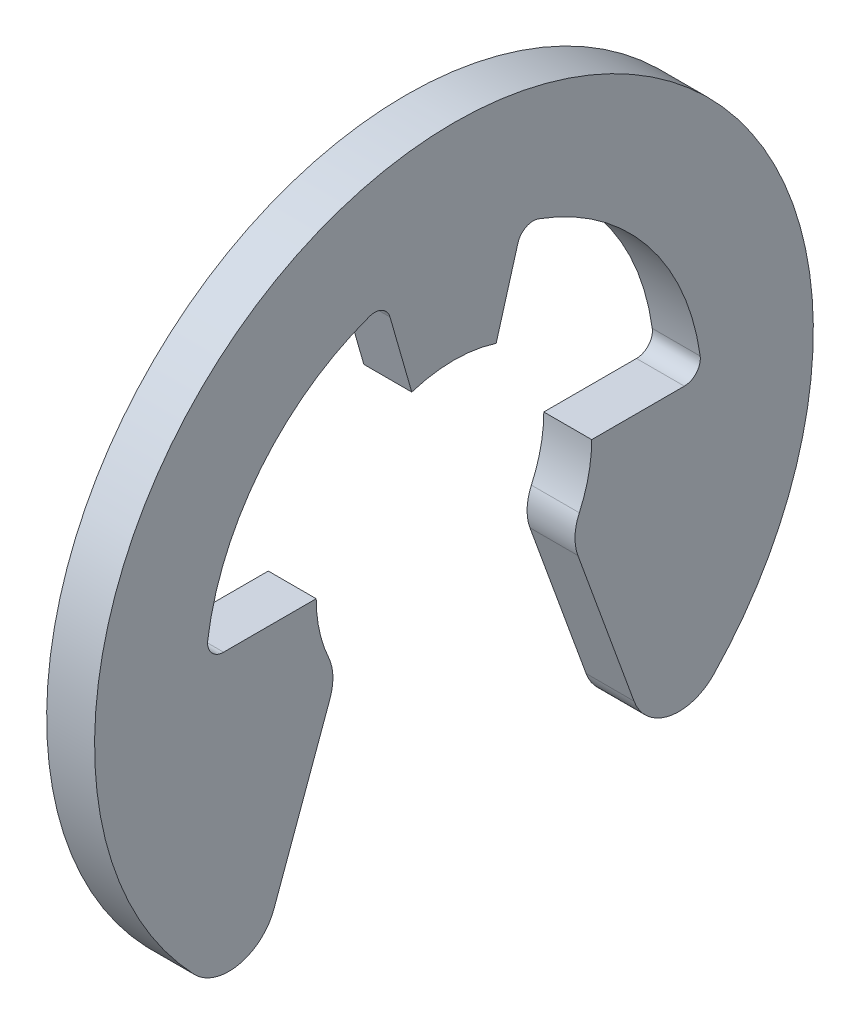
ISO-10303-21;
HEADER;
FILE_DESCRIPTION(('STEP AP214'),'2;1');
FILE_NAME('part.step','',(''),(''),'','','');
FILE_SCHEMA(('AUTOMOTIVE_DESIGN { 1 0 10303 214 1 1 1 1 }'));
ENDSEC;
DATA;
#1=APPLICATION_CONTEXT('core data for automotive mechanical design processes');
#2=APPLICATION_PROTOCOL_DEFINITION('international standard','automotive_design',2000,#1);
#3=PRODUCT_CONTEXT('',#1,'mechanical');
#4=PRODUCT('Part','Part','',(#3));
#5=PRODUCT_RELATED_PRODUCT_CATEGORY('part','',(#4));
#6=PRODUCT_DEFINITION_FORMATION('','',#4);
#7=PRODUCT_DEFINITION_CONTEXT('part definition',#1,'design');
#8=PRODUCT_DEFINITION('design','',#6,#7);
#9=PRODUCT_DEFINITION_SHAPE('','',#8);
#10=(LENGTH_UNIT() NAMED_UNIT(*) SI_UNIT(.MILLI.,.METRE.));
#11=(NAMED_UNIT(*) PLANE_ANGLE_UNIT() SI_UNIT($,.RADIAN.));
#12=(NAMED_UNIT(*) SI_UNIT($,.STERADIAN.) SOLID_ANGLE_UNIT());
#13=UNCERTAINTY_MEASURE_WITH_UNIT(LENGTH_MEASURE(1.E-05),#10,'distance_accuracy_value','');
#14=(GEOMETRIC_REPRESENTATION_CONTEXT(3) GLOBAL_UNCERTAINTY_ASSIGNED_CONTEXT((#13)) GLOBAL_UNIT_ASSIGNED_CONTEXT((#10,
#11,#12)) REPRESENTATION_CONTEXT('',''));
#15=CARTESIAN_POINT('',(0.,0.,0.));
#16=DIRECTION('',(0.,0.,1.));
#17=DIRECTION('',(1.,0.,0.));
#18=AXIS2_PLACEMENT_3D('',#15,#16,#17);
#19=CARTESIAN_POINT('',(0.400000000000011,0.266666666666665,-1.92326761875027));
#20=DIRECTION('',(-1.,0.,0.));
#21=DIRECTION('',(0.,0.,1.));
#22=AXIS2_PLACEMENT_3D('',#19,#20,#21);
#23=CYLINDRICAL_SURFACE('',#22,0.133333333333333);
#24=CARTESIAN_POINT('',(0.,0.266666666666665,-1.92326761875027));
#25=DIRECTION('',(-1.,0.,0.));
#26=DIRECTION('',(0.,0.,1.));
#27=AXIS2_PLACEMENT_3D('',#24,#25,#26);
#28=CIRCLE('',#27,0.133333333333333);
#29=CARTESIAN_POINT('',(0.,0.284978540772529,-2.05533749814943));
#30=VERTEX_POINT('',#29);
#31=CARTESIAN_POINT('',(0.,0.133333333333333,-1.92326761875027));
#32=VERTEX_POINT('',#31);
#33=EDGE_CURVE('E176',#30,#32,#28,.T.);
#34=ORIENTED_EDGE('',*,*,#33,.T.);
#35=DIRECTION('',(-1.,0.,0.));
#36=VECTOR('',#35,1.);
#37=CARTESIAN_POINT('',(0.400000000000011,0.133333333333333,-1.92326761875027));
#38=LINE('',#37,#36);
#39=CARTESIAN_POINT('',(0.400000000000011,0.133333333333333,-1.92326761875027));
#40=VERTEX_POINT('',#39);
#41=EDGE_CURVE('E11',#40,#32,#38,.T.);
#42=ORIENTED_EDGE('',*,*,#41,.F.);
#43=CARTESIAN_POINT('',(0.400000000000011,0.266666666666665,-1.92326761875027));
#44=DIRECTION('',(-1.,0.,0.));
#45=DIRECTION('',(0.,0.,1.));
#46=AXIS2_PLACEMENT_3D('',#43,#44,#45);
#47=CIRCLE('',#46,0.133333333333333);
#48=CARTESIAN_POINT('',(0.400000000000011,0.284978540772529,-2.05533749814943));
#49=VERTEX_POINT('',#48);
#50=EDGE_CURVE('E235',#49,#40,#47,.T.);
#51=ORIENTED_EDGE('',*,*,#50,.F.);
#52=DIRECTION('',(-1.,0.,0.));
#53=VECTOR('',#52,1.);
#54=CARTESIAN_POINT('',(0.400000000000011,0.284978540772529,-2.05533749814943));
#55=LINE('',#54,#53);
#56=EDGE_CURVE('E44',#49,#30,#55,.T.);
#57=ORIENTED_EDGE('',*,*,#56,.T.);
#58=EDGE_LOOP('',(#34,#42,#51,#57));
#59=FACE_BOUND('',#58,.T.);
#60=ADVANCED_FACE('F30',(#59),#23,.F.);
#61=CARTESIAN_POINT('',(0.400000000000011,0.133333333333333,-1.15));
#62=DIRECTION('',(0.,1.,0.));
#63=DIRECTION('',(0.,0.,1.));
#64=AXIS2_PLACEMENT_3D('',#61,#62,#63);
#65=PLANE('',#64);
#66=DIRECTION('',(0.,0.,-1.));
#67=VECTOR('',#66,1.);
#68=CARTESIAN_POINT('',(0.,0.133333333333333,-1.15));
#69=LINE('',#68,#67);
#70=CARTESIAN_POINT('',(0.,0.133333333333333,-1.15));
#71=VERTEX_POINT('',#70);
#72=EDGE_CURVE('E171',#71,#32,#69,.T.);
#73=ORIENTED_EDGE('',*,*,#72,.F.);
#74=DIRECTION('',(-1.,0.,0.));
#75=VECTOR('',#74,1.);
#76=CARTESIAN_POINT('',(0.400000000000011,0.133333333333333,-1.15));
#77=LINE('',#76,#75);
#78=CARTESIAN_POINT('',(0.400000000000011,0.133333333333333,-1.15));
#79=VERTEX_POINT('',#78);
#80=EDGE_CURVE('E37',#79,#71,#77,.T.);
#81=ORIENTED_EDGE('',*,*,#80,.F.);
#82=DIRECTION('',(0.,0.,-1.));
#83=VECTOR('',#82,1.);
#84=CARTESIAN_POINT('',(0.400000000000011,0.133333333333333,-1.15));
#85=LINE('',#84,#83);
#86=EDGE_CURVE('E173',#79,#40,#85,.T.);
#87=ORIENTED_EDGE('',*,*,#86,.T.);
#88=ORIENTED_EDGE('',*,*,#41,.T.);
#89=EDGE_LOOP('',(#73,#81,#87,#88));
#90=FACE_BOUND('',#89,.T.);
#91=ADVANCED_FACE('F169',(#90),#65,.T.);
#92=CARTESIAN_POINT('',(0.400000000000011,0.133333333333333,0.));
#93=DIRECTION('',(-1.,0.,0.));
#94=DIRECTION('',(0.,0.,1.));
#95=AXIS2_PLACEMENT_3D('',#92,#93,#94);
#96=CYLINDRICAL_SURFACE('',#95,1.15);
#97=CARTESIAN_POINT('',(0.,0.133333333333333,0.));
#98=DIRECTION('',(-1.,0.,0.));
#99=DIRECTION('',(0.,0.,1.));
#100=AXIS2_PLACEMENT_3D('',#97,#98,#99);
#101=CIRCLE('',#100,1.15);
#102=CARTESIAN_POINT('',(0.,-0.343754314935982,-1.04636866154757));
#103=VERTEX_POINT('',#102);
#104=EDGE_CURVE('E184',#71,#103,#101,.T.);
#105=ORIENTED_EDGE('',*,*,#104,.T.);
#106=DIRECTION('',(-1.,0.,0.));
#107=VECTOR('',#106,1.);
#108=CARTESIAN_POINT('',(0.400000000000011,-0.343754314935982,-1.04636866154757));
#109=LINE('',#108,#107);
#110=CARTESIAN_POINT('',(0.400000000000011,-0.343754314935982,-1.04636866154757));
#111=VERTEX_POINT('',#110);
#112=EDGE_CURVE('E315',#111,#103,#109,.T.);
#113=ORIENTED_EDGE('',*,*,#112,.F.);
#114=CARTESIAN_POINT('',(0.400000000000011,0.133333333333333,0.));
#115=DIRECTION('',(-1.,0.,0.));
#116=DIRECTION('',(0.,0.,1.));
#117=AXIS2_PLACEMENT_3D('',#114,#115,#116);
#118=CIRCLE('',#117,1.15);
#119=EDGE_CURVE('E238',#79,#111,#118,.T.);
#120=ORIENTED_EDGE('',*,*,#119,.F.);
#121=ORIENTED_EDGE('',*,*,#80,.T.);
#122=EDGE_LOOP('',(#105,#113,#120,#121));
#123=FACE_BOUND('',#122,.T.);
#124=ADVANCED_FACE('F318',(#123),#96,.F.);
#125=CARTESIAN_POINT('',(0.400000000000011,-0.509697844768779,-1.4103229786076));
#126=DIRECTION('',(-1.,0.,0.));
#127=DIRECTION('',(0.,0.,1.));
#128=AXIS2_PLACEMENT_3D('',#125,#126,#127);
#129=CYLINDRICAL_SURFACE('',#128,0.400000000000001);
#130=CARTESIAN_POINT('',(0.,-0.509697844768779,-1.4103229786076));
#131=DIRECTION('',(-1.,0.,0.));
#132=DIRECTION('',(0.,0.,1.));
#133=AXIS2_PLACEMENT_3D('',#130,#131,#132);
#134=CIRCLE('',#133,0.400000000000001);
#135=CARTESIAN_POINT('',(0.,-0.646505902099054,-1.03444593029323));
#136=VERTEX_POINT('',#135);
#137=EDGE_CURVE('E186',#136,#103,#134,.T.);
#138=ORIENTED_EDGE('',*,*,#137,.F.);
#139=DIRECTION('',(-1.,0.,0.));
#140=VECTOR('',#139,1.);
#141=CARTESIAN_POINT('',(0.400000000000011,-0.646505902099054,-1.03444593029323));
#142=LINE('',#141,#140);
#143=CARTESIAN_POINT('',(0.400000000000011,-0.646505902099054,-1.03444593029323));
#144=VERTEX_POINT('',#143);
#145=EDGE_CURVE('E313',#144,#136,#142,.T.);
#146=ORIENTED_EDGE('',*,*,#145,.F.);
#147=CARTESIAN_POINT('',(0.400000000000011,-0.509697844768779,-1.4103229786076));
#148=DIRECTION('',(-1.,0.,0.));
#149=DIRECTION('',(0.,0.,1.));
#150=AXIS2_PLACEMENT_3D('',#147,#148,#149);
#151=CIRCLE('',#150,0.400000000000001);
#152=EDGE_CURVE('E240',#144,#111,#151,.T.);
#153=ORIENTED_EDGE('',*,*,#152,.T.);
#154=ORIENTED_EDGE('',*,*,#112,.T.);
#155=EDGE_LOOP('',(#138,#146,#153,#154));
#156=FACE_BOUND('',#155,.T.);
#157=ADVANCED_FACE('F389',(#156),#129,.T.);
#158=CARTESIAN_POINT('',(0.400000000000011,-0.646505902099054,-1.03444593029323));
#159=DIRECTION('',(0.,0.34202014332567,-0.939692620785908));
#160=DIRECTION('',(0.,0.939692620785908,0.34202014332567));
#161=AXIS2_PLACEMENT_3D('',#158,#159,#160);
#162=PLANE('',#161);
#163=DIRECTION('',(0.,-0.939692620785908,-0.34202014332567));
#164=VECTOR('',#163,1.);
#165=CARTESIAN_POINT('',(0.,-0.646505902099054,-1.03444593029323));
#166=LINE('',#165,#164);
#167=CARTESIAN_POINT('',(0.,-1.9339423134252,-1.50303446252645));
#168=VERTEX_POINT('',#167);
#169=EDGE_CURVE('E190',#136,#168,#166,.T.);
#170=ORIENTED_EDGE('',*,*,#169,.T.);
#171=DIRECTION('',(-1.,0.,0.));
#172=VECTOR('',#171,1.);
#173=CARTESIAN_POINT('',(0.400000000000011,-1.9339423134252,-1.50303446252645));
#174=LINE('',#173,#172);
#175=CARTESIAN_POINT('',(0.400000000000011,-1.9339423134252,-1.50303446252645));
#176=VERTEX_POINT('',#175);
#177=EDGE_CURVE('E311',#176,#168,#174,.T.);
#178=ORIENTED_EDGE('',*,*,#177,.F.);
#179=DIRECTION('',(0.,-0.939692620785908,-0.34202014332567));
#180=VECTOR('',#179,1.);
#181=CARTESIAN_POINT('',(0.400000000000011,-0.646505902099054,-1.03444593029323));
#182=LINE('',#181,#180);
#183=EDGE_CURVE('E243',#144,#176,#182,.T.);
#184=ORIENTED_EDGE('',*,*,#183,.F.);
#185=ORIENTED_EDGE('',*,*,#145,.T.);
#186=EDGE_LOOP('',(#170,#178,#184,#185));
#187=FACE_BOUND('',#186,.T.);
#188=ADVANCED_FACE('F386',(#187),#162,.F.);
#189=CARTESIAN_POINT('',(0.400000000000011,-1.79713425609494,-1.87891151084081));
#190=DIRECTION('',(-1.,0.,0.));
#191=DIRECTION('',(0.,0.,1.));
#192=AXIS2_PLACEMENT_3D('',#189,#190,#191);
#193=CYLINDRICAL_SURFACE('',#192,0.4);
#194=CARTESIAN_POINT('',(0.,-1.79713425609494,-1.87891151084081));
#195=DIRECTION('',(-1.,0.,0.));
#196=DIRECTION('',(0.,0.,1.));
#197=AXIS2_PLACEMENT_3D('',#194,#195,#196);
#198=CIRCLE('',#197,0.4);
#199=CARTESIAN_POINT('',(0.,-2.07361644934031,-2.16797482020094));
#200=VERTEX_POINT('',#199);
#201=EDGE_CURVE('E193',#200,#168,#198,.T.);
#202=ORIENTED_EDGE('',*,*,#201,.F.);
#203=DIRECTION('',(-1.,0.,0.));
#204=VECTOR('',#203,1.);
#205=CARTESIAN_POINT('',(0.400000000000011,-2.07361644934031,-2.16797482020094));
#206=LINE('',#205,#204);
#207=CARTESIAN_POINT('',(0.400000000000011,-2.07361644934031,-2.16797482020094));
#208=VERTEX_POINT('',#207);
#209=EDGE_CURVE('E309',#208,#200,#206,.T.);
#210=ORIENTED_EDGE('',*,*,#209,.F.);
#211=CARTESIAN_POINT('',(0.400000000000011,-1.79713425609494,-1.87891151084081));
#212=DIRECTION('',(-1.,0.,0.));
#213=DIRECTION('',(0.,0.,1.));
#214=AXIS2_PLACEMENT_3D('',#211,#212,#213);
#215=CIRCLE('',#214,0.4);
#216=EDGE_CURVE('E245',#208,#176,#215,.T.);
#217=ORIENTED_EDGE('',*,*,#216,.T.);
#218=ORIENTED_EDGE('',*,*,#177,.T.);
#219=EDGE_LOOP('',(#202,#210,#217,#218));
#220=FACE_BOUND('',#219,.T.);
#221=ADVANCED_FACE('F380',(#220),#193,.T.);
#222=CARTESIAN_POINT('',(0.400000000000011,0.,0.));
#223=DIRECTION('',(-1.,0.,0.));
#224=DIRECTION('',(0.,0.,1.));
#225=AXIS2_PLACEMENT_3D('',#222,#223,#224);
#226=CYLINDRICAL_SURFACE('',#225,3.);
#227=CARTESIAN_POINT('',(0.,0.,0.));
#228=DIRECTION('',(1.,0.,0.));
#229=DIRECTION('',(0.,0.,-1.));
#230=AXIS2_PLACEMENT_3D('',#227,#228,#229);
#231=CIRCLE('',#230,3.);
#232=CARTESIAN_POINT('',(0.,-2.07361644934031,2.16797482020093));
#233=VERTEX_POINT('',#232);
#234=EDGE_CURVE('E196',#200,#233,#231,.T.);
#235=ORIENTED_EDGE('',*,*,#234,.T.);
#236=DIRECTION('',(-1.,0.,0.));
#237=VECTOR('',#236,1.);
#238=CARTESIAN_POINT('',(0.400000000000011,-2.07361644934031,2.16797482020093));
#239=LINE('',#238,#237);
#240=CARTESIAN_POINT('',(0.400000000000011,-2.07361644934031,2.16797482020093));
#241=VERTEX_POINT('',#240);
#242=EDGE_CURVE('E306',#241,#233,#239,.T.);
#243=ORIENTED_EDGE('',*,*,#242,.F.);
#244=CARTESIAN_POINT('',(0.400000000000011,0.,0.));
#245=DIRECTION('',(1.,0.,0.));
#246=DIRECTION('',(0.,0.,-1.));
#247=AXIS2_PLACEMENT_3D('',#244,#245,#246);
#248=CIRCLE('',#247,3.);
#249=EDGE_CURVE('E248',#208,#241,#248,.T.);
#250=ORIENTED_EDGE('',*,*,#249,.F.);
#251=ORIENTED_EDGE('',*,*,#209,.T.);
#252=EDGE_LOOP('',(#235,#243,#250,#251));
#253=FACE_BOUND('',#252,.T.);
#254=ADVANCED_FACE('F390',(#253),#226,.T.);
#255=CARTESIAN_POINT('',(0.400000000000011,-1.79713425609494,1.87891151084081));
#256=DIRECTION('',(-1.,0.,0.));
#257=DIRECTION('',(0.,0.,1.));
#258=AXIS2_PLACEMENT_3D('',#255,#256,#257);
#259=CYLINDRICAL_SURFACE('',#258,0.4);
#260=CARTESIAN_POINT('',(0.,-1.79713425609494,1.87891151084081));
#261=DIRECTION('',(1.,0.,0.));
#262=DIRECTION('',(0.,0.,-1.));
#263=AXIS2_PLACEMENT_3D('',#260,#261,#262);
#264=CIRCLE('',#263,0.4);
#265=CARTESIAN_POINT('',(0.,-1.9339423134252,1.50303446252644));
#266=VERTEX_POINT('',#265);
#267=EDGE_CURVE('E198',#233,#266,#264,.T.);
#268=ORIENTED_EDGE('',*,*,#267,.T.);
#269=DIRECTION('',(-1.,0.,0.));
#270=VECTOR('',#269,1.);
#271=CARTESIAN_POINT('',(0.400000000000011,-1.9339423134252,1.50303446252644));
#272=LINE('',#271,#270);
#273=CARTESIAN_POINT('',(0.400000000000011,-1.9339423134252,1.50303446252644));
#274=VERTEX_POINT('',#273);
#275=EDGE_CURVE('E304',#274,#266,#272,.T.);
#276=ORIENTED_EDGE('',*,*,#275,.F.);
#277=CARTESIAN_POINT('',(0.400000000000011,-1.79713425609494,1.87891151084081));
#278=DIRECTION('',(1.,0.,0.));
#279=DIRECTION('',(0.,0.,-1.));
#280=AXIS2_PLACEMENT_3D('',#277,#278,#279);
#281=CIRCLE('',#280,0.4);
#282=EDGE_CURVE('E250',#241,#274,#281,.T.);
#283=ORIENTED_EDGE('',*,*,#282,.F.);
#284=ORIENTED_EDGE('',*,*,#242,.T.);
#285=EDGE_LOOP('',(#268,#276,#283,#284));
#286=FACE_BOUND('',#285,.T.);
#287=ADVANCED_FACE('F373',(#286),#259,.T.);
#288=CARTESIAN_POINT('',(0.400000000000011,-0.646505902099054,1.03444593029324));
#289=DIRECTION('',(0.,-0.342020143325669,-0.939692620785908));
#290=DIRECTION('',(0.,0.939692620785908,-0.342020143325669));
#291=AXIS2_PLACEMENT_3D('',#288,#289,#290);
#292=PLANE('',#291);
#293=DIRECTION('',(0.,-0.939692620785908,0.342020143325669));
#294=VECTOR('',#293,1.);
#295=CARTESIAN_POINT('',(0.,-0.646505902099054,1.03444593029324));
#296=LINE('',#295,#294);
#297=CARTESIAN_POINT('',(0.,-0.646505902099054,1.03444593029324));
#298=VERTEX_POINT('',#297);
#299=EDGE_CURVE('E201',#298,#266,#296,.T.);
#300=ORIENTED_EDGE('',*,*,#299,.F.);
#301=DIRECTION('',(-1.,0.,0.));
#302=VECTOR('',#301,1.);
#303=CARTESIAN_POINT('',(0.400000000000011,-0.646505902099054,1.03444593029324));
#304=LINE('',#303,#302);
#305=CARTESIAN_POINT('',(0.400000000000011,-0.646505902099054,1.03444593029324));
#306=VERTEX_POINT('',#305);
#307=EDGE_CURVE('E302',#306,#298,#304,.T.);
#308=ORIENTED_EDGE('',*,*,#307,.F.);
#309=DIRECTION('',(0.,-0.939692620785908,0.342020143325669));
#310=VECTOR('',#309,1.);
#311=CARTESIAN_POINT('',(0.400000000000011,-0.646505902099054,1.03444593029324));
#312=LINE('',#311,#310);
#313=EDGE_CURVE('E252',#306,#274,#312,.T.);
#314=ORIENTED_EDGE('',*,*,#313,.T.);
#315=ORIENTED_EDGE('',*,*,#275,.T.);
#316=EDGE_LOOP('',(#300,#308,#314,#315));
#317=FACE_BOUND('',#316,.T.);
#318=ADVANCED_FACE('F368',(#317),#292,.T.);
#319=CARTESIAN_POINT('',(0.400000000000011,-0.509697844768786,1.4103229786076));
#320=DIRECTION('',(-1.,0.,0.));
#321=DIRECTION('',(0.,0.,1.));
#322=AXIS2_PLACEMENT_3D('',#319,#320,#321);
#323=CYLINDRICAL_SURFACE('',#322,0.400000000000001);
#324=CARTESIAN_POINT('',(0.,-0.509697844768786,1.4103229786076));
#325=DIRECTION('',(1.,0.,0.));
#326=DIRECTION('',(0.,0.,-1.));
#327=AXIS2_PLACEMENT_3D('',#324,#325,#326);
#328=CIRCLE('',#327,0.400000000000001);
#329=CARTESIAN_POINT('',(0.,-0.343754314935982,1.04636866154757));
#330=VERTEX_POINT('',#329);
#331=EDGE_CURVE('E204',#298,#330,#328,.T.);
#332=ORIENTED_EDGE('',*,*,#331,.T.);
#333=DIRECTION('',(-1.,0.,0.));
#334=VECTOR('',#333,1.);
#335=CARTESIAN_POINT('',(0.400000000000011,-0.343754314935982,1.04636866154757));
#336=LINE('',#335,#334);
#337=CARTESIAN_POINT('',(0.400000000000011,-0.343754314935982,1.04636866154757));
#338=VERTEX_POINT('',#337);
#339=EDGE_CURVE('E300',#338,#330,#336,.T.);
#340=ORIENTED_EDGE('',*,*,#339,.F.);
#341=CARTESIAN_POINT('',(0.400000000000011,-0.509697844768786,1.4103229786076));
#342=DIRECTION('',(1.,0.,0.));
#343=DIRECTION('',(0.,0.,-1.));
#344=AXIS2_PLACEMENT_3D('',#341,#342,#343);
#345=CIRCLE('',#344,0.400000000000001);
#346=EDGE_CURVE('E255',#306,#338,#345,.T.);
#347=ORIENTED_EDGE('',*,*,#346,.F.);
#348=ORIENTED_EDGE('',*,*,#307,.T.);
#349=EDGE_LOOP('',(#332,#340,#347,#348));
#350=FACE_BOUND('',#349,.T.);
#351=ADVANCED_FACE('F364',(#350),#323,.T.);
#352=CARTESIAN_POINT('',(0.400000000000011,0.133333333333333,0.));
#353=DIRECTION('',(-1.,0.,0.));
#354=DIRECTION('',(0.,0.,1.));
#355=AXIS2_PLACEMENT_3D('',#352,#353,#354);
#356=CYLINDRICAL_SURFACE('',#355,1.15);
#357=CARTESIAN_POINT('',(0.,0.133333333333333,0.));
#358=DIRECTION('',(1.,0.,0.));
#359=DIRECTION('',(0.,0.,-1.));
#360=AXIS2_PLACEMENT_3D('',#357,#358,#359);
#361=CIRCLE('',#360,1.15);
#362=CARTESIAN_POINT('',(0.,0.133333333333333,1.15000000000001));
#363=VERTEX_POINT('',#362);
#364=EDGE_CURVE('E207',#363,#330,#361,.T.);
#365=ORIENTED_EDGE('',*,*,#364,.F.);
#366=DIRECTION('',(-1.,0.,0.));
#367=VECTOR('',#366,1.);
#368=CARTESIAN_POINT('',(0.400000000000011,0.133333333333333,1.15000000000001));
#369=LINE('',#368,#367);
#370=CARTESIAN_POINT('',(0.400000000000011,0.133333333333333,1.15000000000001));
#371=VERTEX_POINT('',#370);
#372=EDGE_CURVE('E298',#371,#363,#369,.T.);
#373=ORIENTED_EDGE('',*,*,#372,.F.);
#374=CARTESIAN_POINT('',(0.400000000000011,0.133333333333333,0.));
#375=DIRECTION('',(1.,0.,0.));
#376=DIRECTION('',(0.,0.,-1.));
#377=AXIS2_PLACEMENT_3D('',#374,#375,#376);
#378=CIRCLE('',#377,1.15);
#379=EDGE_CURVE('E257',#371,#338,#378,.T.);
#380=ORIENTED_EDGE('',*,*,#379,.T.);
#381=ORIENTED_EDGE('',*,*,#339,.T.);
#382=EDGE_LOOP('',(#365,#373,#380,#381));
#383=FACE_BOUND('',#382,.T.);
#384=ADVANCED_FACE('F358',(#383),#356,.F.);
#385=CARTESIAN_POINT('',(0.400000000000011,0.133333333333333,1.15000000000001));
#386=DIRECTION('',(0.,-1.,0.));
#387=DIRECTION('',(0.,0.,-1.));
#388=AXIS2_PLACEMENT_3D('',#385,#386,#387);
#389=PLANE('',#388);
#390=DIRECTION('',(0.,0.,1.));
#391=VECTOR('',#390,1.);
#392=CARTESIAN_POINT('',(0.,0.133333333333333,1.15000000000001));
#393=LINE('',#392,#391);
#394=CARTESIAN_POINT('',(0.,0.133333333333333,1.92326761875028));
#395=VERTEX_POINT('',#394);
#396=EDGE_CURVE('E210',#363,#395,#393,.T.);
#397=ORIENTED_EDGE('',*,*,#396,.T.);
#398=DIRECTION('',(-1.,0.,0.));
#399=VECTOR('',#398,1.);
#400=CARTESIAN_POINT('',(0.400000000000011,0.133333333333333,1.92326761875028));
#401=LINE('',#400,#399);
#402=CARTESIAN_POINT('',(0.400000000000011,0.133333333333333,1.92326761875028));
#403=VERTEX_POINT('',#402);
#404=EDGE_CURVE('E296',#403,#395,#401,.T.);
#405=ORIENTED_EDGE('',*,*,#404,.F.);
#406=DIRECTION('',(0.,0.,1.));
#407=VECTOR('',#406,1.);
#408=CARTESIAN_POINT('',(0.400000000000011,0.133333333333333,1.15000000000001));
#409=LINE('',#408,#407);
#410=EDGE_CURVE('E260',#371,#403,#409,.T.);
#411=ORIENTED_EDGE('',*,*,#410,.F.);
#412=ORIENTED_EDGE('',*,*,#372,.T.);
#413=EDGE_LOOP('',(#397,#405,#411,#412));
#414=FACE_BOUND('',#413,.T.);
#415=ADVANCED_FACE('F454',(#414),#389,.F.);
#416=CARTESIAN_POINT('',(0.400000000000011,0.266666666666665,1.92326761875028));
#417=DIRECTION('',(-1.,0.,0.));
#418=DIRECTION('',(0.,0.,1.));
#419=AXIS2_PLACEMENT_3D('',#416,#417,#418);
#420=CYLINDRICAL_SURFACE('',#419,0.133333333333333);
#421=CARTESIAN_POINT('',(0.,0.266666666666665,1.92326761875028));
#422=DIRECTION('',(1.,0.,0.));
#423=DIRECTION('',(0.,0.,-1.));
#424=AXIS2_PLACEMENT_3D('',#421,#422,#423);
#425=CIRCLE('',#424,0.133333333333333);
#426=CARTESIAN_POINT('',(0.,0.284978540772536,2.05533749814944));
#427=VERTEX_POINT('',#426);
#428=EDGE_CURVE('E213',#427,#395,#425,.T.);
#429=ORIENTED_EDGE('',*,*,#428,.F.);
#430=DIRECTION('',(-1.,0.,0.));
#431=VECTOR('',#430,1.);
#432=CARTESIAN_POINT('',(0.400000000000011,0.284978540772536,2.05533749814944));
#433=LINE('',#432,#431);
#434=CARTESIAN_POINT('',(0.400000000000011,0.284978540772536,2.05533749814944));
#435=VERTEX_POINT('',#434);
#436=EDGE_CURVE('E294',#435,#427,#433,.T.);
#437=ORIENTED_EDGE('',*,*,#436,.F.);
#438=CARTESIAN_POINT('',(0.400000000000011,0.266666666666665,1.92326761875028));
#439=DIRECTION('',(1.,0.,0.));
#440=DIRECTION('',(0.,0.,-1.));
#441=AXIS2_PLACEMENT_3D('',#438,#439,#440);
#442=CIRCLE('',#441,0.133333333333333);
#443=EDGE_CURVE('E262',#435,#403,#442,.T.);
#444=ORIENTED_EDGE('',*,*,#443,.T.);
#445=ORIENTED_EDGE('',*,*,#404,.T.);
#446=EDGE_LOOP('',(#429,#437,#444,#445));
#447=FACE_BOUND('',#446,.T.);
#448=ADVANCED_FACE('F351',(#447),#420,.F.);
#449=CARTESIAN_POINT('',(0.400000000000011,0.,0.));
#450=DIRECTION('',(-1.,0.,0.));
#451=DIRECTION('',(0.,0.,1.));
#452=AXIS2_PLACEMENT_3D('',#449,#450,#451);
#453=CYLINDRICAL_SURFACE('',#452,2.075);
#454=CARTESIAN_POINT('',(0.,0.,0.));
#455=DIRECTION('',(-1.,0.,0.));
#456=DIRECTION('',(0.,0.,1.));
#457=AXIS2_PLACEMENT_3D('',#454,#455,#456);
#458=CIRCLE('',#457,2.075);
#459=CARTESIAN_POINT('',(0.,1.95063428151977,0.707566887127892));
#460=VERTEX_POINT('',#459);
#461=EDGE_CURVE('E216',#427,#460,#458,.T.);
#462=ORIENTED_EDGE('',*,*,#461,.T.);
#463=DIRECTION('',(-1.,0.,0.));
#464=VECTOR('',#463,1.);
#465=CARTESIAN_POINT('',(0.400000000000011,1.95063428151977,0.707566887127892));
#466=LINE('',#465,#464);
#467=CARTESIAN_POINT('',(0.400000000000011,1.95063428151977,0.707566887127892));
#468=VERTEX_POINT('',#467);
#469=EDGE_CURVE('E291',#468,#460,#466,.T.);
#470=ORIENTED_EDGE('',*,*,#469,.F.);
#471=CARTESIAN_POINT('',(0.400000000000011,0.,0.));
#472=DIRECTION('',(-1.,0.,0.));
#473=DIRECTION('',(0.,0.,1.));
#474=AXIS2_PLACEMENT_3D('',#471,#472,#473);
#475=CIRCLE('',#474,2.075);
#476=EDGE_CURVE('E265',#435,#468,#475,.T.);
#477=ORIENTED_EDGE('',*,*,#476,.F.);
#478=ORIENTED_EDGE('',*,*,#436,.T.);
#479=EDGE_LOOP('',(#462,#470,#477,#478));
#480=FACE_BOUND('',#479,.T.);
#481=ADVANCED_FACE('F348',(#480),#453,.F.);
#482=CARTESIAN_POINT('',(0.400000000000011,1.82529231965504,0.662100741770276));
#483=DIRECTION('',(-1.,0.,0.));
#484=DIRECTION('',(0.,0.,1.));
#485=AXIS2_PLACEMENT_3D('',#482,#483,#484);
#486=CYLINDRICAL_SURFACE('',#485,0.133333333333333);
#487=CARTESIAN_POINT('',(0.,1.82529231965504,0.662100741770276));
#488=DIRECTION('',(-1.,0.,0.));
#489=DIRECTION('',(0.,0.,1.));
#490=AXIS2_PLACEMENT_3D('',#487,#488,#489);
#491=CIRCLE('',#490,0.133333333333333);
#492=CARTESIAN_POINT('',(0.,1.86204396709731,0.533932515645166));
#493=VERTEX_POINT('',#492);
#494=EDGE_CURVE('E218',#460,#493,#491,.T.);
#495=ORIENTED_EDGE('',*,*,#494,.T.);
#496=DIRECTION('',(-1.,0.,0.));
#497=VECTOR('',#496,1.);
#498=CARTESIAN_POINT('',(0.400000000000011,1.86204396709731,0.533932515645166));
#499=LINE('',#498,#497);
#500=CARTESIAN_POINT('',(0.400000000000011,1.86204396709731,0.533932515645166));
#501=VERTEX_POINT('',#500);
#502=EDGE_CURVE('E289',#501,#493,#499,.T.);
#503=ORIENTED_EDGE('',*,*,#502,.F.);
#504=CARTESIAN_POINT('',(0.400000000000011,1.82529231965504,0.662100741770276));
#505=DIRECTION('',(-1.,0.,0.));
#506=DIRECTION('',(0.,0.,1.));
#507=AXIS2_PLACEMENT_3D('',#504,#505,#506);
#508=CIRCLE('',#507,0.133333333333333);
#509=EDGE_CURVE('E267',#468,#501,#508,.T.);
#510=ORIENTED_EDGE('',*,*,#509,.F.);
#511=ORIENTED_EDGE('',*,*,#469,.T.);
#512=EDGE_LOOP('',(#495,#503,#510,#511));
#513=FACE_BOUND('',#512,.T.);
#514=ADVANCED_FACE('F343',(#513),#486,.F.);
#515=CARTESIAN_POINT('',(0.400000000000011,1.22808950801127,0.352148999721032));
#516=DIRECTION('',(0.,-0.275637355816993,0.961261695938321));
#517=DIRECTION('',(0.,-0.961261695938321,-0.275637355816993));
#518=AXIS2_PLACEMENT_3D('',#515,#516,#517);
#519=PLANE('',#518);
#520=DIRECTION('',(0.,0.961261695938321,0.275637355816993));
#521=VECTOR('',#520,1.);
#522=CARTESIAN_POINT('',(0.,1.22808950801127,0.352148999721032));
#523=LINE('',#522,#521);
#524=CARTESIAN_POINT('',(0.,1.22808950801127,0.352148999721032));
#525=VERTEX_POINT('',#524);
#526=EDGE_CURVE('E221',#525,#493,#523,.T.);
#527=ORIENTED_EDGE('',*,*,#526,.F.);
#528=DIRECTION('',(-1.,0.,0.));
#529=VECTOR('',#528,1.);
#530=CARTESIAN_POINT('',(0.400000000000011,1.22808950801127,0.352148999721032));
#531=LINE('',#530,#529);
#532=CARTESIAN_POINT('',(0.400000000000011,1.22808950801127,0.352148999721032));
#533=VERTEX_POINT('',#532);
#534=EDGE_CURVE('E287',#533,#525,#531,.T.);
#535=ORIENTED_EDGE('',*,*,#534,.F.);
#536=DIRECTION('',(0.,0.961261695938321,0.275637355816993));
#537=VECTOR('',#536,1.);
#538=CARTESIAN_POINT('',(0.400000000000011,1.22808950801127,0.352148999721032));
#539=LINE('',#538,#537);
#540=EDGE_CURVE('E269',#533,#501,#539,.T.);
#541=ORIENTED_EDGE('',*,*,#540,.T.);
#542=ORIENTED_EDGE('',*,*,#502,.T.);
#543=EDGE_LOOP('',(#527,#535,#541,#542));
#544=FACE_BOUND('',#543,.T.);
#545=ADVANCED_FACE('F337',(#544),#519,.T.);
#546=CARTESIAN_POINT('',(0.400000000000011,0.133333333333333,0.));
#547=DIRECTION('',(-1.,0.,0.));
#548=DIRECTION('',(0.,0.,1.));
#549=AXIS2_PLACEMENT_3D('',#546,#547,#548);
#550=CYLINDRICAL_SURFACE('',#549,1.15);
#551=CARTESIAN_POINT('',(0.,0.133333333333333,0.));
#552=DIRECTION('',(1.,0.,0.));
#553=DIRECTION('',(0.,0.,-1.));
#554=AXIS2_PLACEMENT_3D('',#551,#552,#553);
#555=CIRCLE('',#554,1.15);
#556=CARTESIAN_POINT('',(0.,1.22808950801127,-0.352148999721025));
#557=VERTEX_POINT('',#556);
#558=EDGE_CURVE('E224',#557,#525,#555,.T.);
#559=ORIENTED_EDGE('',*,*,#558,.F.);
#560=DIRECTION('',(-1.,0.,0.));
#561=VECTOR('',#560,1.);
#562=CARTESIAN_POINT('',(0.400000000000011,1.22808950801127,-0.352148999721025));
#563=LINE('',#562,#561);
#564=CARTESIAN_POINT('',(0.400000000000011,1.22808950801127,-0.352148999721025));
#565=VERTEX_POINT('',#564);
#566=EDGE_CURVE('E285',#565,#557,#563,.T.);
#567=ORIENTED_EDGE('',*,*,#566,.F.);
#568=CARTESIAN_POINT('',(0.400000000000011,0.133333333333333,0.));
#569=DIRECTION('',(1.,0.,0.));
#570=DIRECTION('',(0.,0.,-1.));
#571=AXIS2_PLACEMENT_3D('',#568,#569,#570);
#572=CIRCLE('',#571,1.15);
#573=EDGE_CURVE('E272',#565,#533,#572,.T.);
#574=ORIENTED_EDGE('',*,*,#573,.T.);
#575=ORIENTED_EDGE('',*,*,#534,.T.);
#576=EDGE_LOOP('',(#559,#567,#574,#575));
#577=FACE_BOUND('',#576,.T.);
#578=ADVANCED_FACE('F331',(#577),#550,.F.);
#579=CARTESIAN_POINT('',(0.400000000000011,1.22808950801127,-0.352148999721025));
#580=DIRECTION('',(0.,0.275637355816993,0.96126169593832));
#581=DIRECTION('',(0.,-0.961261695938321,0.275637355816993));
#582=AXIS2_PLACEMENT_3D('',#579,#580,#581);
#583=PLANE('',#582);
#584=DIRECTION('',(0.,0.96126169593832,-0.275637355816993));
#585=VECTOR('',#584,1.);
#586=CARTESIAN_POINT('',(0.,1.22808950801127,-0.352148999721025));
#587=LINE('',#586,#585);
#588=CARTESIAN_POINT('',(0.,1.86204396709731,-0.533932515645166));
#589=VERTEX_POINT('',#588);
#590=EDGE_CURVE('E227',#557,#589,#587,.T.);
#591=ORIENTED_EDGE('',*,*,#590,.T.);
#592=DIRECTION('',(-1.,0.,0.));
#593=VECTOR('',#592,1.);
#594=CARTESIAN_POINT('',(0.400000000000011,1.86204396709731,-0.533932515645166));
#595=LINE('',#594,#593);
#596=CARTESIAN_POINT('',(0.400000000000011,1.86204396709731,-0.533932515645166));
#597=VERTEX_POINT('',#596);
#598=EDGE_CURVE('E283',#597,#589,#595,.T.);
#599=ORIENTED_EDGE('',*,*,#598,.F.);
#600=DIRECTION('',(0.,0.96126169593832,-0.275637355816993));
#601=VECTOR('',#600,1.);
#602=CARTESIAN_POINT('',(0.400000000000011,1.22808950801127,-0.352148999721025));
#603=LINE('',#602,#601);
#604=EDGE_CURVE('E275',#565,#597,#603,.T.);
#605=ORIENTED_EDGE('',*,*,#604,.F.);
#606=ORIENTED_EDGE('',*,*,#566,.T.);
#607=EDGE_LOOP('',(#591,#599,#605,#606));
#608=FACE_BOUND('',#607,.T.);
#609=ADVANCED_FACE('F503',(#608),#583,.F.);
#610=CARTESIAN_POINT('',(0.400000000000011,1.82529231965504,-0.662100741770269));
#611=DIRECTION('',(-1.,0.,0.));
#612=DIRECTION('',(0.,0.,1.));
#613=AXIS2_PLACEMENT_3D('',#610,#611,#612);
#614=CYLINDRICAL_SURFACE('',#613,0.133333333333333);
#615=CARTESIAN_POINT('',(0.,1.82529231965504,-0.662100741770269));
#616=DIRECTION('',(1.,0.,0.));
#617=DIRECTION('',(0.,0.,-1.));
#618=AXIS2_PLACEMENT_3D('',#615,#616,#617);
#619=CIRCLE('',#618,0.133333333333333);
#620=CARTESIAN_POINT('',(0.,1.95063428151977,-0.707566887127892));
#621=VERTEX_POINT('',#620);
#622=EDGE_CURVE('E230',#621,#589,#619,.T.);
#623=ORIENTED_EDGE('',*,*,#622,.F.);
#624=DIRECTION('',(-1.,0.,0.));
#625=VECTOR('',#624,1.);
#626=CARTESIAN_POINT('',(0.400000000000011,1.95063428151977,-0.707566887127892));
#627=LINE('',#626,#625);
#628=CARTESIAN_POINT('',(0.400000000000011,1.95063428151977,-0.707566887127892));
#629=VERTEX_POINT('',#628);
#630=EDGE_CURVE('E52',#629,#621,#627,.T.);
#631=ORIENTED_EDGE('',*,*,#630,.F.);
#632=CARTESIAN_POINT('',(0.400000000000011,1.82529231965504,-0.662100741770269));
#633=DIRECTION('',(1.,0.,0.));
#634=DIRECTION('',(0.,0.,-1.));
#635=AXIS2_PLACEMENT_3D('',#632,#633,#634);
#636=CIRCLE('',#635,0.133333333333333);
#637=EDGE_CURVE('E277',#629,#597,#636,.T.);
#638=ORIENTED_EDGE('',*,*,#637,.T.);
#639=ORIENTED_EDGE('',*,*,#598,.T.);
#640=EDGE_LOOP('',(#623,#631,#638,#639));
#641=FACE_BOUND('',#640,.T.);
#642=ADVANCED_FACE('F325',(#641),#614,.F.);
#643=CARTESIAN_POINT('',(0.400000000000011,0.,0.));
#644=DIRECTION('',(-1.,0.,0.));
#645=DIRECTION('',(0.,0.,1.));
#646=AXIS2_PLACEMENT_3D('',#643,#644,#645);
#647=CYLINDRICAL_SURFACE('',#646,2.075);
#648=CARTESIAN_POINT('',(0.,0.,0.));
#649=DIRECTION('',(1.,0.,0.));
#650=DIRECTION('',(0.,0.,-1.));
#651=AXIS2_PLACEMENT_3D('',#648,#649,#650);
#652=CIRCLE('',#651,2.075);
#653=EDGE_CURVE('E233',#30,#621,#652,.T.);
#654=ORIENTED_EDGE('',*,*,#653,.F.);
#655=ORIENTED_EDGE('',*,*,#56,.F.);
#656=CARTESIAN_POINT('',(0.400000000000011,0.,0.));
#657=DIRECTION('',(1.,0.,0.));
#658=DIRECTION('',(0.,0.,-1.));
#659=AXIS2_PLACEMENT_3D('',#656,#657,#658);
#660=CIRCLE('',#659,2.075);
#661=EDGE_CURVE('E279',#49,#629,#660,.T.);
#662=ORIENTED_EDGE('',*,*,#661,.T.);
#663=ORIENTED_EDGE('',*,*,#630,.T.);
#664=EDGE_LOOP('',(#654,#655,#662,#663));
#665=FACE_BOUND('',#664,.T.);
#666=ADVANCED_FACE('F324',(#665),#647,.F.);
#667=CARTESIAN_POINT('',(0.400000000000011,0.266666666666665,-1.92326761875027));
#668=DIRECTION('',(-1.,0.,0.));
#669=DIRECTION('',(0.,0.,1.));
#670=AXIS2_PLACEMENT_3D('',#667,#668,#669);
#671=PLANE('',#670);
#672=ORIENTED_EDGE('',*,*,#50,.T.);
#673=ORIENTED_EDGE('',*,*,#86,.F.);
#674=ORIENTED_EDGE('',*,*,#119,.T.);
#675=ORIENTED_EDGE('',*,*,#152,.F.);
#676=ORIENTED_EDGE('',*,*,#183,.T.);
#677=ORIENTED_EDGE('',*,*,#216,.F.);
#678=ORIENTED_EDGE('',*,*,#249,.T.);
#679=ORIENTED_EDGE('',*,*,#282,.T.);
#680=ORIENTED_EDGE('',*,*,#313,.F.);
#681=ORIENTED_EDGE('',*,*,#346,.T.);
#682=ORIENTED_EDGE('',*,*,#379,.F.);
#683=ORIENTED_EDGE('',*,*,#410,.T.);
#684=ORIENTED_EDGE('',*,*,#443,.F.);
#685=ORIENTED_EDGE('',*,*,#476,.T.);
#686=ORIENTED_EDGE('',*,*,#509,.T.);
#687=ORIENTED_EDGE('',*,*,#540,.F.);
#688=ORIENTED_EDGE('',*,*,#573,.F.);
#689=ORIENTED_EDGE('',*,*,#604,.T.);
#690=ORIENTED_EDGE('',*,*,#637,.F.);
#691=ORIENTED_EDGE('',*,*,#661,.F.);
#692=EDGE_LOOP('',(#672,#673,#674,#675,#676,#677,#678,#679,#680,#681,#682,#683,#684,#685,#686,
#687,#688,#689,#690,#691));
#693=FACE_BOUND('',#692,.T.);
#694=ADVANCED_FACE('F322',(#693),#671,.F.);
#695=CARTESIAN_POINT('',(0.,0.266666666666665,-1.92326761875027));
#696=DIRECTION('',(-1.,0.,0.));
#697=DIRECTION('',(0.,0.,1.));
#698=AXIS2_PLACEMENT_3D('',#695,#696,#697);
#699=PLANE('',#698);
#700=ORIENTED_EDGE('',*,*,#33,.F.);
#701=ORIENTED_EDGE('',*,*,#653,.T.);
#702=ORIENTED_EDGE('',*,*,#622,.T.);
#703=ORIENTED_EDGE('',*,*,#590,.F.);
#704=ORIENTED_EDGE('',*,*,#558,.T.);
#705=ORIENTED_EDGE('',*,*,#526,.T.);
#706=ORIENTED_EDGE('',*,*,#494,.F.);
#707=ORIENTED_EDGE('',*,*,#461,.F.);
#708=ORIENTED_EDGE('',*,*,#428,.T.);
#709=ORIENTED_EDGE('',*,*,#396,.F.);
#710=ORIENTED_EDGE('',*,*,#364,.T.);
#711=ORIENTED_EDGE('',*,*,#331,.F.);
#712=ORIENTED_EDGE('',*,*,#299,.T.);
#713=ORIENTED_EDGE('',*,*,#267,.F.);
#714=ORIENTED_EDGE('',*,*,#234,.F.);
#715=ORIENTED_EDGE('',*,*,#201,.T.);
#716=ORIENTED_EDGE('',*,*,#169,.F.);
#717=ORIENTED_EDGE('',*,*,#137,.T.);
#718=ORIENTED_EDGE('',*,*,#104,.F.);
#719=ORIENTED_EDGE('',*,*,#72,.T.);
#720=EDGE_LOOP('',(#700,#701,#702,#703,#704,#705,#706,#707,#708,#709,#710,#711,#712,#713,#714,
#715,#716,#717,#718,#719));
#721=FACE_BOUND('',#720,.T.);
#722=ADVANCED_FACE('F181',(#721),#699,.T.);
#723=CLOSED_SHELL('',(#60,#91,#124,#157,#188,#221,#254,#287,#318,#351,#384,#415,#448,#481,#514,
#545,#578,#609,#642,#666,#694,#722));
#724=MANIFOLD_SOLID_BREP('B2',#723);
#725=ADVANCED_BREP_SHAPE_REPRESENTATION('',(#18,#724),#14);
#726=SHAPE_DEFINITION_REPRESENTATION(#9,#725);
ENDSEC;
END-ISO-10303-21;
